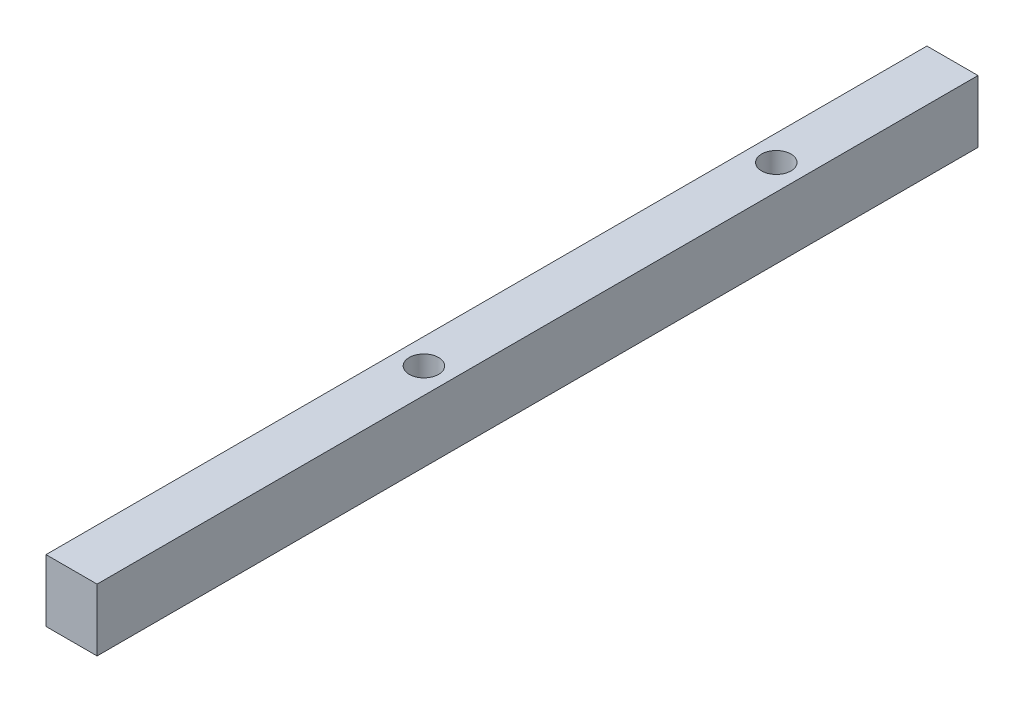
from build123d import *

# Parameters (mm, degrees)
SKETCH1_W           = 8.7
SKETCH1_H           = 150
SKETCH1_R           = 2.5
BOSS_EXTRUDE1_DEPTH = 10.6


with BuildPart() as part:
    # Sketch1 → Boss-Extrude1 (new body)
    with BuildSketch(Plane(origin=(0, 0, 0), x_dir=(1, 0, 0), z_dir=(0, 1, 0))):
        with Locations((4.35, 75)):
            Rectangle(SKETCH1_W, SKETCH1_H)
        with Locations(Location((4.35, 60, 0), (0, 0, 270))):
            Circle(SKETCH1_R, mode=Mode.SUBTRACT)
        with Locations(Location((4.35, 120, 0), (0, 0, 270))):
            Circle(SKETCH1_R, mode=Mode.SUBTRACT)
    extrude(amount=BOSS_EXTRUDE1_DEPTH)


solid = part.part
